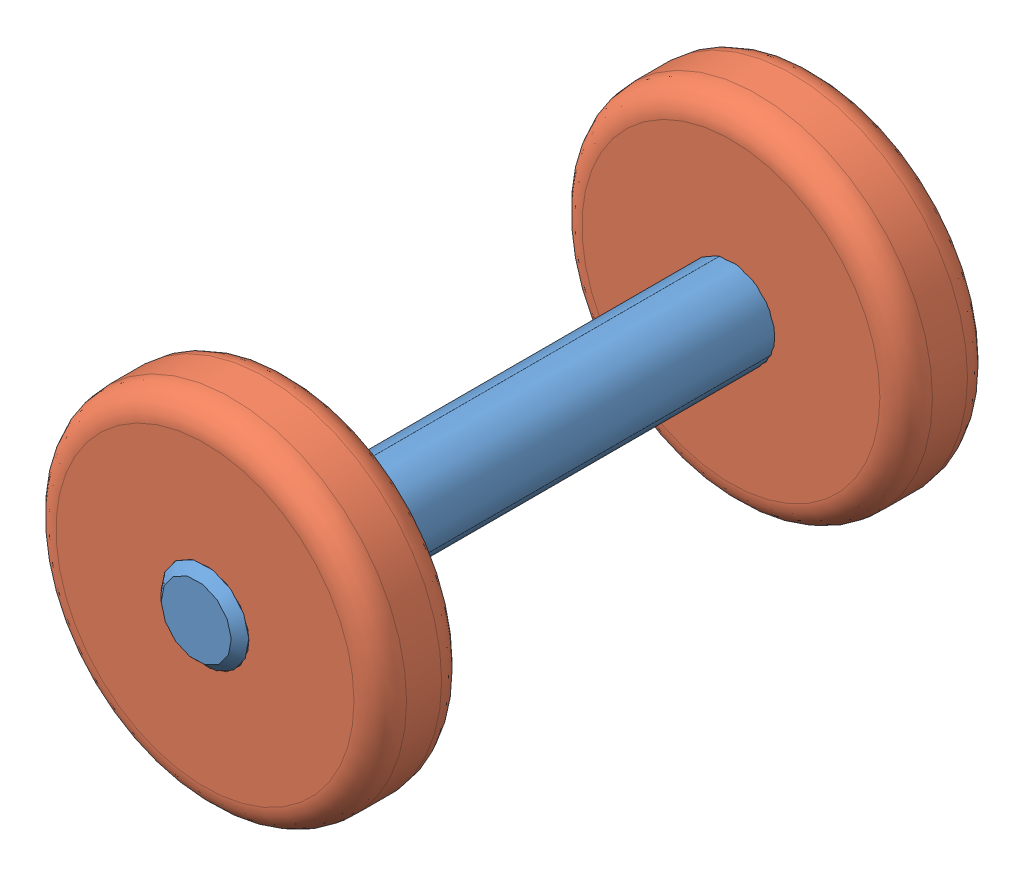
SolidWorks assembly 001.01.sldasm, configuration Default (file format 3400). Lengths in mm.
Overall size (40 40 72).
3 component instances, 2 part files, 3 mates.
Components (placement in the parent):
- 000.02-1: 000.02.sldprt [Default] at (-24.492 11.4619 -1) x (0.654083 -0.756423 0) z (0 0 1) size (10 10 72)
- 000.03-1: 000.03.sldprt [Default] at (0 0 60) size (40 40 10)
- 000.03-2: 000.03.sldprt [Default] at origin size (40 40 10)
Mates (geometry in assembly coordinates):
- Концентрический1: concentric aligned: cylinder of 000.02-1; cylinder of 000.03-1
- Совпадение1: coincident anti-aligned: circle of 000.02-1; plane of 000.03-1 through (-21.1503 29.963 70) normal (0 0 1)
- Совпадение2: coincident anti-aligned: circle of 000.02-1; plane of 000.03-2 through (-21.1503 29.963 0) normal (0 0 -1)
